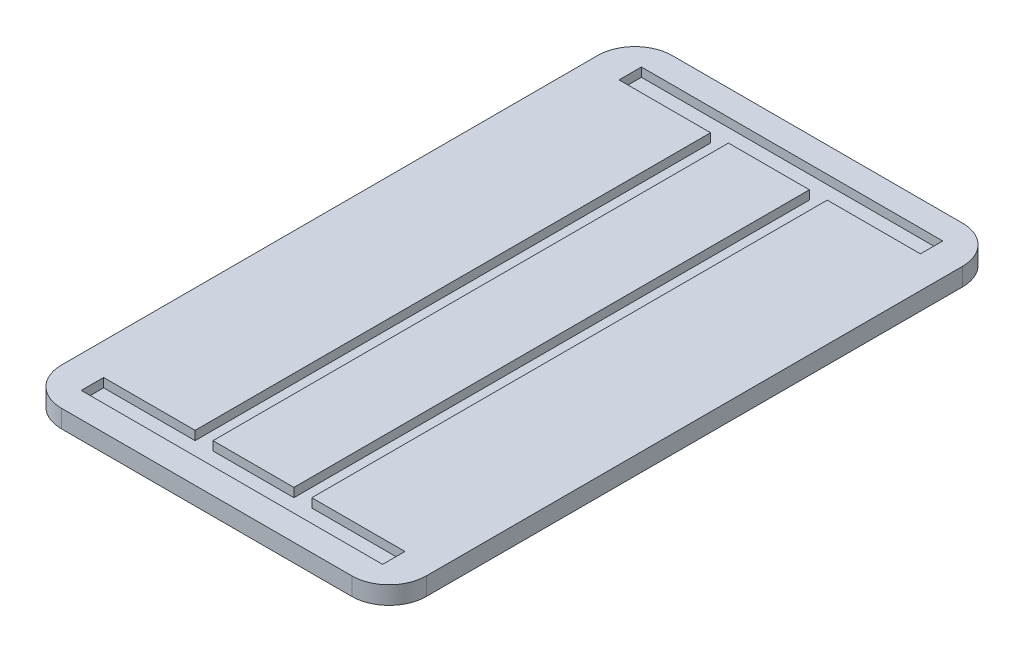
ISO-10303-21;
HEADER;
FILE_DESCRIPTION(('STEP AP214'),'2;1');
FILE_NAME('part.step','',(''),(''),'','','');
FILE_SCHEMA(('AUTOMOTIVE_DESIGN { 1 0 10303 214 1 1 1 1 }'));
ENDSEC;
DATA;
#1=APPLICATION_CONTEXT('core data for automotive mechanical design processes');
#2=APPLICATION_PROTOCOL_DEFINITION('international standard','automotive_design',2000,#1);
#3=PRODUCT_CONTEXT('',#1,'mechanical');
#4=PRODUCT('Part','Part','',(#3));
#5=PRODUCT_RELATED_PRODUCT_CATEGORY('part','',(#4));
#6=PRODUCT_DEFINITION_FORMATION('','',#4);
#7=PRODUCT_DEFINITION_CONTEXT('part definition',#1,'design');
#8=PRODUCT_DEFINITION('design','',#6,#7);
#9=PRODUCT_DEFINITION_SHAPE('','',#8);
#10=(LENGTH_UNIT() NAMED_UNIT(*) SI_UNIT(.MILLI.,.METRE.));
#11=(NAMED_UNIT(*) PLANE_ANGLE_UNIT() SI_UNIT($,.RADIAN.));
#12=(NAMED_UNIT(*) SI_UNIT($,.STERADIAN.) SOLID_ANGLE_UNIT());
#13=UNCERTAINTY_MEASURE_WITH_UNIT(LENGTH_MEASURE(1.E-05),#10,'distance_accuracy_value','');
#14=(GEOMETRIC_REPRESENTATION_CONTEXT(3) GLOBAL_UNCERTAINTY_ASSIGNED_CONTEXT((#13)) GLOBAL_UNIT_ASSIGNED_CONTEXT((#10,
#11,#12)) REPRESENTATION_CONTEXT('',''));
#15=CARTESIAN_POINT('',(0.,0.,0.));
#16=DIRECTION('',(0.,0.,1.));
#17=DIRECTION('',(1.,0.,0.));
#18=AXIS2_PLACEMENT_3D('',#15,#16,#17);
#19=CARTESIAN_POINT('',(101.14,12.,0.));
#20=DIRECTION('',(1.,0.,0.));
#21=DIRECTION('',(0.,0.,-1.));
#22=AXIS2_PLACEMENT_3D('',#19,#20,#21);
#23=PLANE('',#22);
#24=DIRECTION('',(0.,-1.,0.));
#25=VECTOR('',#24,1.);
#26=CARTESIAN_POINT('',(101.14,12.,-188.));
#27=LINE('',#26,#25);
#28=CARTESIAN_POINT('',(101.14,12.,-188.));
#29=VERTEX_POINT('',#28);
#30=CARTESIAN_POINT('',(101.14,6.,-188.));
#31=VERTEX_POINT('',#30);
#32=EDGE_CURVE('E379',#29,#31,#27,.T.);
#33=ORIENTED_EDGE('',*,*,#32,.T.);
#34=DIRECTION('',(0.,0.,1.));
#35=VECTOR('',#34,1.);
#36=CARTESIAN_POINT('',(101.14,6.,0.));
#37=LINE('',#36,#35);
#38=CARTESIAN_POINT('',(101.14,6.,-173.));
#39=VERTEX_POINT('',#38);
#40=EDGE_CURVE('E87',#31,#39,#37,.T.);
#41=ORIENTED_EDGE('',*,*,#40,.T.);
#42=DIRECTION('',(0.,-1.,0.));
#43=VECTOR('',#42,1.);
#44=CARTESIAN_POINT('',(101.14,12.,-173.));
#45=LINE('',#44,#43);
#46=CARTESIAN_POINT('',(101.14,12.,-173.));
#47=VERTEX_POINT('',#46);
#48=EDGE_CURVE('E12',#47,#39,#45,.T.);
#49=ORIENTED_EDGE('',*,*,#48,.F.);
#50=DIRECTION('',(0.,0.,1.));
#51=VECTOR('',#50,1.);
#52=CARTESIAN_POINT('',(101.14,12.,0.));
#53=LINE('',#52,#51);
#54=EDGE_CURVE('E327',#29,#47,#53,.T.);
#55=ORIENTED_EDGE('',*,*,#54,.F.);
#56=EDGE_LOOP('',(#33,#41,#49,#55));
#57=FACE_BOUND('',#56,.T.);
#58=ADVANCED_FACE('F70',(#57),#23,.F.);
#59=CARTESIAN_POINT('',(0.,12.,-173.));
#60=DIRECTION('',(0.,0.,1.));
#61=DIRECTION('',(1.,0.,0.));
#62=AXIS2_PLACEMENT_3D('',#59,#60,#61);
#63=PLANE('',#62);
#64=ORIENTED_EDGE('',*,*,#48,.T.);
#65=DIRECTION('',(-1.,0.,0.));
#66=VECTOR('',#65,1.);
#67=CARTESIAN_POINT('',(0.,6.,-173.));
#68=LINE('',#67,#66);
#69=CARTESIAN_POINT('',(38.6199999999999,6.,-173.));
#70=VERTEX_POINT('',#69);
#71=EDGE_CURVE('E93',#39,#70,#68,.T.);
#72=ORIENTED_EDGE('',*,*,#71,.T.);
#73=DIRECTION('',(0.,-1.,0.));
#74=VECTOR('',#73,1.);
#75=CARTESIAN_POINT('',(38.6199999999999,12.,-173.));
#76=LINE('',#75,#74);
#77=CARTESIAN_POINT('',(38.6199999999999,12.,-173.));
#78=VERTEX_POINT('',#77);
#79=EDGE_CURVE('E79',#78,#70,#76,.T.);
#80=ORIENTED_EDGE('',*,*,#79,.F.);
#81=DIRECTION('',(-1.,0.,0.));
#82=VECTOR('',#81,1.);
#83=CARTESIAN_POINT('',(0.,12.,-173.));
#84=LINE('',#83,#82);
#85=EDGE_CURVE('E330',#47,#78,#84,.T.);
#86=ORIENTED_EDGE('',*,*,#85,.F.);
#87=EDGE_LOOP('',(#64,#72,#80,#86));
#88=FACE_BOUND('',#87,.T.);
#89=ADVANCED_FACE('F466',(#88),#63,.F.);
#90=CARTESIAN_POINT('',(38.6199999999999,12.,0.));
#91=DIRECTION('',(1.,0.,0.));
#92=DIRECTION('',(0.,0.,-1.));
#93=AXIS2_PLACEMENT_3D('',#90,#91,#92);
#94=PLANE('',#93);
#95=ORIENTED_EDGE('',*,*,#79,.T.);
#96=DIRECTION('',(0.,0.,1.));
#97=VECTOR('',#96,1.);
#98=CARTESIAN_POINT('',(38.6199999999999,6.,0.));
#99=LINE('',#98,#97);
#100=CARTESIAN_POINT('',(38.6199999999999,6.,173.));
#101=VERTEX_POINT('',#100);
#102=EDGE_CURVE('E293',#70,#101,#99,.T.);
#103=ORIENTED_EDGE('',*,*,#102,.T.);
#104=DIRECTION('',(0.,-1.,0.));
#105=VECTOR('',#104,1.);
#106=CARTESIAN_POINT('',(38.6199999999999,12.,173.));
#107=LINE('',#106,#105);
#108=CARTESIAN_POINT('',(38.6199999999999,12.,173.));
#109=VERTEX_POINT('',#108);
#110=EDGE_CURVE('E404',#109,#101,#107,.T.);
#111=ORIENTED_EDGE('',*,*,#110,.F.);
#112=DIRECTION('',(0.,0.,1.));
#113=VECTOR('',#112,1.);
#114=CARTESIAN_POINT('',(38.6199999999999,12.,0.));
#115=LINE('',#114,#113);
#116=EDGE_CURVE('E332',#78,#109,#115,.T.);
#117=ORIENTED_EDGE('',*,*,#116,.F.);
#118=EDGE_LOOP('',(#95,#103,#111,#117));
#119=FACE_BOUND('',#118,.T.);
#120=ADVANCED_FACE('F476',(#119),#94,.F.);
#121=CARTESIAN_POINT('',(0.,12.,173.));
#122=DIRECTION('',(0.,0.,-1.));
#123=DIRECTION('',(-1.,0.,0.));
#124=AXIS2_PLACEMENT_3D('',#121,#122,#123);
#125=PLANE('',#124);
#126=ORIENTED_EDGE('',*,*,#110,.T.);
#127=DIRECTION('',(1.,0.,0.));
#128=VECTOR('',#127,1.);
#129=CARTESIAN_POINT('',(0.,6.,173.));
#130=LINE('',#129,#128);
#131=CARTESIAN_POINT('',(101.14,6.,173.));
#132=VERTEX_POINT('',#131);
#133=EDGE_CURVE('E291',#101,#132,#130,.T.);
#134=ORIENTED_EDGE('',*,*,#133,.T.);
#135=DIRECTION('',(0.,-1.,0.));
#136=VECTOR('',#135,1.);
#137=CARTESIAN_POINT('',(101.14,12.,173.));
#138=LINE('',#137,#136);
#139=CARTESIAN_POINT('',(101.14,12.,173.));
#140=VERTEX_POINT('',#139);
#141=EDGE_CURVE('E401',#140,#132,#138,.T.);
#142=ORIENTED_EDGE('',*,*,#141,.F.);
#143=DIRECTION('',(1.,0.,0.));
#144=VECTOR('',#143,1.);
#145=CARTESIAN_POINT('',(0.,12.,173.));
#146=LINE('',#145,#144);
#147=EDGE_CURVE('E334',#109,#140,#146,.T.);
#148=ORIENTED_EDGE('',*,*,#147,.F.);
#149=EDGE_LOOP('',(#126,#134,#142,#148));
#150=FACE_BOUND('',#149,.T.);
#151=ADVANCED_FACE('F480',(#150),#125,.F.);
#152=CARTESIAN_POINT('',(101.14,12.,0.));
#153=DIRECTION('',(1.,0.,0.));
#154=DIRECTION('',(0.,0.,-1.));
#155=AXIS2_PLACEMENT_3D('',#152,#153,#154);
#156=PLANE('',#155);
#157=ORIENTED_EDGE('',*,*,#141,.T.);
#158=DIRECTION('',(0.,0.,1.));
#159=VECTOR('',#158,1.);
#160=CARTESIAN_POINT('',(101.14,6.,0.));
#161=LINE('',#160,#159);
#162=CARTESIAN_POINT('',(101.14,6.,188.));
#163=VERTEX_POINT('',#162);
#164=EDGE_CURVE('E289',#132,#163,#161,.T.);
#165=ORIENTED_EDGE('',*,*,#164,.T.);
#166=DIRECTION('',(0.,-1.,0.));
#167=VECTOR('',#166,1.);
#168=CARTESIAN_POINT('',(101.14,12.,188.));
#169=LINE('',#168,#167);
#170=CARTESIAN_POINT('',(101.14,12.,188.));
#171=VERTEX_POINT('',#170);
#172=EDGE_CURVE('E398',#171,#163,#169,.T.);
#173=ORIENTED_EDGE('',*,*,#172,.F.);
#174=DIRECTION('',(0.,0.,1.));
#175=VECTOR('',#174,1.);
#176=CARTESIAN_POINT('',(101.14,12.,0.));
#177=LINE('',#176,#175);
#178=EDGE_CURVE('E336',#140,#171,#177,.T.);
#179=ORIENTED_EDGE('',*,*,#178,.F.);
#180=EDGE_LOOP('',(#157,#165,#173,#179));
#181=FACE_BOUND('',#180,.T.);
#182=ADVANCED_FACE('F488',(#181),#156,.F.);
#183=CARTESIAN_POINT('',(0.,12.,188.));
#184=DIRECTION('',(0.,0.,1.));
#185=DIRECTION('',(1.,0.,0.));
#186=AXIS2_PLACEMENT_3D('',#183,#184,#185);
#187=PLANE('',#186);
#188=ORIENTED_EDGE('',*,*,#172,.T.);
#189=DIRECTION('',(1.,0.,0.));
#190=VECTOR('',#189,1.);
#191=CARTESIAN_POINT('',(0.,6.,188.));
#192=LINE('',#191,#190);
#193=CARTESIAN_POINT('',(-101.14,6.,188.));
#194=VERTEX_POINT('',#193);
#195=EDGE_CURVE('E286',#194,#163,#192,.T.);
#196=ORIENTED_EDGE('',*,*,#195,.F.);
#197=DIRECTION('',(0.,-1.,0.));
#198=VECTOR('',#197,1.);
#199=CARTESIAN_POINT('',(-101.14,12.,188.));
#200=LINE('',#199,#198);
#201=CARTESIAN_POINT('',(-101.14,12.,188.));
#202=VERTEX_POINT('',#201);
#203=EDGE_CURVE('E395',#202,#194,#200,.T.);
#204=ORIENTED_EDGE('',*,*,#203,.F.);
#205=DIRECTION('',(-1.,0.,0.));
#206=VECTOR('',#205,1.);
#207=CARTESIAN_POINT('',(0.,12.,188.));
#208=LINE('',#207,#206);
#209=EDGE_CURVE('E338',#171,#202,#208,.T.);
#210=ORIENTED_EDGE('',*,*,#209,.F.);
#211=EDGE_LOOP('',(#188,#196,#204,#210));
#212=FACE_BOUND('',#211,.T.);
#213=ADVANCED_FACE('F490',(#212),#187,.F.);
#214=CARTESIAN_POINT('',(-101.14,12.,0.));
#215=DIRECTION('',(1.,0.,0.));
#216=DIRECTION('',(0.,0.,-1.));
#217=AXIS2_PLACEMENT_3D('',#214,#215,#216);
#218=PLANE('',#217);
#219=DIRECTION('',(0.,0.,1.));
#220=VECTOR('',#219,1.);
#221=CARTESIAN_POINT('',(-101.14,6.,0.));
#222=LINE('',#221,#220);
#223=CARTESIAN_POINT('',(-101.14,6.,173.));
#224=VERTEX_POINT('',#223);
#225=EDGE_CURVE('E283',#224,#194,#222,.T.);
#226=ORIENTED_EDGE('',*,*,#225,.F.);
#227=DIRECTION('',(0.,-1.,0.));
#228=VECTOR('',#227,1.);
#229=CARTESIAN_POINT('',(-101.14,12.,173.));
#230=LINE('',#229,#228);
#231=CARTESIAN_POINT('',(-101.14,12.,173.));
#232=VERTEX_POINT('',#231);
#233=EDGE_CURVE('E392',#232,#224,#230,.T.);
#234=ORIENTED_EDGE('',*,*,#233,.F.);
#235=DIRECTION('',(0.,0.,1.));
#236=VECTOR('',#235,1.);
#237=CARTESIAN_POINT('',(-101.14,12.,0.));
#238=LINE('',#237,#236);
#239=EDGE_CURVE('E340',#232,#202,#238,.T.);
#240=ORIENTED_EDGE('',*,*,#239,.T.);
#241=ORIENTED_EDGE('',*,*,#203,.T.);
#242=EDGE_LOOP('',(#226,#234,#240,#241));
#243=FACE_BOUND('',#242,.T.);
#244=ADVANCED_FACE('F492',(#243),#218,.T.);
#245=CARTESIAN_POINT('',(0.,12.,173.));
#246=DIRECTION('',(0.,0.,1.));
#247=DIRECTION('',(1.,0.,0.));
#248=AXIS2_PLACEMENT_3D('',#245,#246,#247);
#249=PLANE('',#248);
#250=DIRECTION('',(-1.,0.,0.));
#251=VECTOR('',#250,1.);
#252=CARTESIAN_POINT('',(0.,6.,173.));
#253=LINE('',#252,#251);
#254=CARTESIAN_POINT('',(-39.7100000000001,6.,173.));
#255=VERTEX_POINT('',#254);
#256=EDGE_CURVE('E280',#255,#224,#253,.T.);
#257=ORIENTED_EDGE('',*,*,#256,.F.);
#258=DIRECTION('',(0.,-1.,0.));
#259=VECTOR('',#258,1.);
#260=CARTESIAN_POINT('',(-39.7100000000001,12.,173.));
#261=LINE('',#260,#259);
#262=CARTESIAN_POINT('',(-39.7100000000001,12.,173.));
#263=VERTEX_POINT('',#262);
#264=EDGE_CURVE('E389',#263,#255,#261,.T.);
#265=ORIENTED_EDGE('',*,*,#264,.F.);
#266=DIRECTION('',(-1.,0.,0.));
#267=VECTOR('',#266,1.);
#268=CARTESIAN_POINT('',(0.,12.,173.));
#269=LINE('',#268,#267);
#270=EDGE_CURVE('E343',#263,#232,#269,.T.);
#271=ORIENTED_EDGE('',*,*,#270,.T.);
#272=ORIENTED_EDGE('',*,*,#233,.T.);
#273=EDGE_LOOP('',(#257,#265,#271,#272));
#274=FACE_BOUND('',#273,.T.);
#275=ADVANCED_FACE('F496',(#274),#249,.T.);
#276=CARTESIAN_POINT('',(-39.7100000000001,12.,0.));
#277=DIRECTION('',(1.,0.,0.));
#278=DIRECTION('',(0.,0.,-1.));
#279=AXIS2_PLACEMENT_3D('',#276,#277,#278);
#280=PLANE('',#279);
#281=DIRECTION('',(0.,0.,-1.));
#282=VECTOR('',#281,1.);
#283=CARTESIAN_POINT('',(-39.7100000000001,6.,0.));
#284=LINE('',#283,#282);
#285=CARTESIAN_POINT('',(-39.7100000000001,6.,-173.));
#286=VERTEX_POINT('',#285);
#287=EDGE_CURVE('E278',#255,#286,#284,.T.);
#288=ORIENTED_EDGE('',*,*,#287,.T.);
#289=DIRECTION('',(0.,-1.,0.));
#290=VECTOR('',#289,1.);
#291=CARTESIAN_POINT('',(-39.7100000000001,12.,-173.));
#292=LINE('',#291,#290);
#293=CARTESIAN_POINT('',(-39.7100000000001,12.,-173.));
#294=VERTEX_POINT('',#293);
#295=EDGE_CURVE('E386',#294,#286,#292,.T.);
#296=ORIENTED_EDGE('',*,*,#295,.F.);
#297=DIRECTION('',(0.,0.,1.));
#298=VECTOR('',#297,1.);
#299=CARTESIAN_POINT('',(-39.7100000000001,12.,0.));
#300=LINE('',#299,#298);
#301=EDGE_CURVE('E346',#294,#263,#300,.T.);
#302=ORIENTED_EDGE('',*,*,#301,.T.);
#303=ORIENTED_EDGE('',*,*,#264,.T.);
#304=EDGE_LOOP('',(#288,#296,#302,#303));
#305=FACE_BOUND('',#304,.T.);
#306=ADVANCED_FACE('F499',(#305),#280,.T.);
#307=CARTESIAN_POINT('',(0.,12.,-173.));
#308=DIRECTION('',(0.,0.,-1.));
#309=DIRECTION('',(-1.,0.,0.));
#310=AXIS2_PLACEMENT_3D('',#307,#308,#309);
#311=PLANE('',#310);
#312=DIRECTION('',(1.,0.,0.));
#313=VECTOR('',#312,1.);
#314=CARTESIAN_POINT('',(0.,6.,-173.));
#315=LINE('',#314,#313);
#316=CARTESIAN_POINT('',(-101.14,6.,-173.));
#317=VERTEX_POINT('',#316);
#318=EDGE_CURVE('E275',#317,#286,#315,.T.);
#319=ORIENTED_EDGE('',*,*,#318,.F.);
#320=DIRECTION('',(0.,-1.,0.));
#321=VECTOR('',#320,1.);
#322=CARTESIAN_POINT('',(-101.14,12.,-173.));
#323=LINE('',#322,#321);
#324=CARTESIAN_POINT('',(-101.14,12.,-173.));
#325=VERTEX_POINT('',#324);
#326=EDGE_CURVE('E383',#325,#317,#323,.T.);
#327=ORIENTED_EDGE('',*,*,#326,.F.);
#328=DIRECTION('',(1.,0.,0.));
#329=VECTOR('',#328,1.);
#330=CARTESIAN_POINT('',(0.,12.,-173.));
#331=LINE('',#330,#329);
#332=EDGE_CURVE('E349',#325,#294,#331,.T.);
#333=ORIENTED_EDGE('',*,*,#332,.T.);
#334=ORIENTED_EDGE('',*,*,#295,.T.);
#335=EDGE_LOOP('',(#319,#327,#333,#334));
#336=FACE_BOUND('',#335,.T.);
#337=ADVANCED_FACE('F502',(#336),#311,.T.);
#338=CARTESIAN_POINT('',(-101.14,12.,0.));
#339=DIRECTION('',(1.,0.,0.));
#340=DIRECTION('',(0.,0.,-1.));
#341=AXIS2_PLACEMENT_3D('',#338,#339,#340);
#342=PLANE('',#341);
#343=DIRECTION('',(0.,0.,1.));
#344=VECTOR('',#343,1.);
#345=CARTESIAN_POINT('',(-101.14,6.,0.));
#346=LINE('',#345,#344);
#347=CARTESIAN_POINT('',(-101.14,6.,-188.));
#348=VERTEX_POINT('',#347);
#349=EDGE_CURVE('E272',#348,#317,#346,.T.);
#350=ORIENTED_EDGE('',*,*,#349,.F.);
#351=DIRECTION('',(0.,-1.,0.));
#352=VECTOR('',#351,1.);
#353=CARTESIAN_POINT('',(-101.14,12.,-188.));
#354=LINE('',#353,#352);
#355=CARTESIAN_POINT('',(-101.14,12.,-188.));
#356=VERTEX_POINT('',#355);
#357=EDGE_CURVE('E381',#356,#348,#354,.T.);
#358=ORIENTED_EDGE('',*,*,#357,.F.);
#359=DIRECTION('',(0.,0.,1.));
#360=VECTOR('',#359,1.);
#361=CARTESIAN_POINT('',(-101.14,12.,0.));
#362=LINE('',#361,#360);
#363=EDGE_CURVE('E352',#356,#325,#362,.T.);
#364=ORIENTED_EDGE('',*,*,#363,.T.);
#365=ORIENTED_EDGE('',*,*,#326,.T.);
#366=EDGE_LOOP('',(#350,#358,#364,#365));
#367=FACE_BOUND('',#366,.T.);
#368=ADVANCED_FACE('F505',(#367),#342,.T.);
#369=CARTESIAN_POINT('',(97.5,12.,-180.));
#370=DIRECTION('',(0.,-1.,0.));
#371=DIRECTION('',(0.,0.,-1.));
#372=AXIS2_PLACEMENT_3D('',#369,#370,#371);
#373=CYLINDRICAL_SURFACE('',#372,25.);
#374=CARTESIAN_POINT('',(97.5,0.,-180.));
#375=DIRECTION('',(0.,1.,0.));
#376=DIRECTION('',(0.,0.,1.));
#377=AXIS2_PLACEMENT_3D('',#374,#375,#376);
#378=CIRCLE('',#377,25.);
#379=CARTESIAN_POINT('',(97.4999999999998,0.,-205.));
#380=VERTEX_POINT('',#379);
#381=CARTESIAN_POINT('',(122.5,0.,-180.));
#382=VERTEX_POINT('',#381);
#383=EDGE_CURVE('E304',#380,#382,#378,.F.);
#384=ORIENTED_EDGE('',*,*,#383,.F.);
#385=DIRECTION('',(0.,-1.,0.));
#386=VECTOR('',#385,1.);
#387=CARTESIAN_POINT('',(97.4999999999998,12.,-205.));
#388=LINE('',#387,#386);
#389=CARTESIAN_POINT('',(97.4999999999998,12.,-205.));
#390=VERTEX_POINT('',#389);
#391=EDGE_CURVE('E74',#390,#380,#388,.T.);
#392=ORIENTED_EDGE('',*,*,#391,.F.);
#393=CARTESIAN_POINT('',(97.5,12.,-180.));
#394=DIRECTION('',(0.,1.,0.));
#395=DIRECTION('',(0.,0.,1.));
#396=AXIS2_PLACEMENT_3D('',#393,#394,#395);
#397=CIRCLE('',#396,25.);
#398=CARTESIAN_POINT('',(122.5,12.,-180.));
#399=VERTEX_POINT('',#398);
#400=EDGE_CURVE('E305',#390,#399,#397,.F.);
#401=ORIENTED_EDGE('',*,*,#400,.T.);
#402=DIRECTION('',(0.,-1.,0.));
#403=VECTOR('',#402,1.);
#404=CARTESIAN_POINT('',(122.5,12.,-180.));
#405=LINE('',#404,#403);
#406=EDGE_CURVE('E358',#399,#382,#405,.T.);
#407=ORIENTED_EDGE('',*,*,#406,.T.);
#408=EDGE_LOOP('',(#384,#392,#401,#407));
#409=FACE_BOUND('',#408,.T.);
#410=ADVANCED_FACE('F72',(#409),#373,.T.);
#411=CARTESIAN_POINT('',(0.,12.,-205.));
#412=DIRECTION('',(0.,0.,1.));
#413=DIRECTION('',(1.,0.,0.));
#414=AXIS2_PLACEMENT_3D('',#411,#412,#413);
#415=PLANE('',#414);
#416=DIRECTION('',(-1.,0.,0.));
#417=VECTOR('',#416,1.);
#418=CARTESIAN_POINT('',(0.,0.,-205.));
#419=LINE('',#418,#417);
#420=CARTESIAN_POINT('',(-97.4999999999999,0.,-205.));
#421=VERTEX_POINT('',#420);
#422=EDGE_CURVE('E361',#380,#421,#419,.T.);
#423=ORIENTED_EDGE('',*,*,#422,.T.);
#424=DIRECTION('',(0.,-1.,0.));
#425=VECTOR('',#424,1.);
#426=CARTESIAN_POINT('',(-97.4999999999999,12.,-205.));
#427=LINE('',#426,#425);
#428=CARTESIAN_POINT('',(-97.4999999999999,12.,-205.));
#429=VERTEX_POINT('',#428);
#430=EDGE_CURVE('E419',#429,#421,#427,.T.);
#431=ORIENTED_EDGE('',*,*,#430,.F.);
#432=DIRECTION('',(-1.,0.,0.));
#433=VECTOR('',#432,1.);
#434=CARTESIAN_POINT('',(0.,12.,-205.));
#435=LINE('',#434,#433);
#436=EDGE_CURVE('E308',#390,#429,#435,.T.);
#437=ORIENTED_EDGE('',*,*,#436,.F.);
#438=ORIENTED_EDGE('',*,*,#391,.T.);
#439=EDGE_LOOP('',(#423,#431,#437,#438));
#440=FACE_BOUND('',#439,.T.);
#441=ADVANCED_FACE('F428',(#440),#415,.F.);
#442=CARTESIAN_POINT('',(-97.5,12.,-180.));
#443=DIRECTION('',(0.,-1.,0.));
#444=DIRECTION('',(0.,0.,-1.));
#445=AXIS2_PLACEMENT_3D('',#442,#443,#444);
#446=CYLINDRICAL_SURFACE('',#445,25.);
#447=CARTESIAN_POINT('',(-97.5,0.,-180.));
#448=DIRECTION('',(0.,1.,0.));
#449=DIRECTION('',(0.,0.,1.));
#450=AXIS2_PLACEMENT_3D('',#447,#448,#449);
#451=CIRCLE('',#450,25.);
#452=CARTESIAN_POINT('',(-122.5,0.,-180.));
#453=VERTEX_POINT('',#452);
#454=EDGE_CURVE('E363',#421,#453,#451,.T.);
#455=ORIENTED_EDGE('',*,*,#454,.T.);
#456=DIRECTION('',(0.,-1.,0.));
#457=VECTOR('',#456,1.);
#458=CARTESIAN_POINT('',(-122.5,12.,-180.));
#459=LINE('',#458,#457);
#460=CARTESIAN_POINT('',(-122.5,12.,-180.));
#461=VERTEX_POINT('',#460);
#462=EDGE_CURVE('E417',#461,#453,#459,.T.);
#463=ORIENTED_EDGE('',*,*,#462,.F.);
#464=CARTESIAN_POINT('',(-97.5,12.,-180.));
#465=DIRECTION('',(0.,1.,0.));
#466=DIRECTION('',(0.,0.,1.));
#467=AXIS2_PLACEMENT_3D('',#464,#465,#466);
#468=CIRCLE('',#467,25.);
#469=EDGE_CURVE('E311',#429,#461,#468,.T.);
#470=ORIENTED_EDGE('',*,*,#469,.F.);
#471=ORIENTED_EDGE('',*,*,#430,.T.);
#472=EDGE_LOOP('',(#455,#463,#470,#471));
#473=FACE_BOUND('',#472,.T.);
#474=ADVANCED_FACE('F456',(#473),#446,.T.);
#475=CARTESIAN_POINT('',(-122.5,12.,0.));
#476=DIRECTION('',(1.,0.,0.));
#477=DIRECTION('',(0.,0.,-1.));
#478=AXIS2_PLACEMENT_3D('',#475,#476,#477);
#479=PLANE('',#478);
#480=DIRECTION('',(0.,0.,1.));
#481=VECTOR('',#480,1.);
#482=CARTESIAN_POINT('',(-122.5,0.,0.));
#483=LINE('',#482,#481);
#484=CARTESIAN_POINT('',(-122.5,0.,180.));
#485=VERTEX_POINT('',#484);
#486=EDGE_CURVE('E365',#453,#485,#483,.T.);
#487=ORIENTED_EDGE('',*,*,#486,.T.);
#488=DIRECTION('',(0.,-1.,0.));
#489=VECTOR('',#488,1.);
#490=CARTESIAN_POINT('',(-122.5,12.,180.));
#491=LINE('',#490,#489);
#492=CARTESIAN_POINT('',(-122.5,12.,180.));
#493=VERTEX_POINT('',#492);
#494=EDGE_CURVE('E415',#493,#485,#491,.T.);
#495=ORIENTED_EDGE('',*,*,#494,.F.);
#496=DIRECTION('',(0.,0.,1.));
#497=VECTOR('',#496,1.);
#498=CARTESIAN_POINT('',(-122.5,12.,0.));
#499=LINE('',#498,#497);
#500=EDGE_CURVE('E313',#461,#493,#499,.T.);
#501=ORIENTED_EDGE('',*,*,#500,.F.);
#502=ORIENTED_EDGE('',*,*,#462,.T.);
#503=EDGE_LOOP('',(#487,#495,#501,#502));
#504=FACE_BOUND('',#503,.T.);
#505=ADVANCED_FACE('F453',(#504),#479,.F.);
#506=CARTESIAN_POINT('',(-97.5,12.,180.));
#507=DIRECTION('',(0.,-1.,0.));
#508=DIRECTION('',(0.,0.,-1.));
#509=AXIS2_PLACEMENT_3D('',#506,#507,#508);
#510=CYLINDRICAL_SURFACE('',#509,25.);
#511=CARTESIAN_POINT('',(-97.5,0.,180.));
#512=DIRECTION('',(0.,1.,0.));
#513=DIRECTION('',(0.,0.,1.));
#514=AXIS2_PLACEMENT_3D('',#511,#512,#513);
#515=CIRCLE('',#514,25.);
#516=CARTESIAN_POINT('',(-97.4999999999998,0.,205.));
#517=VERTEX_POINT('',#516);
#518=EDGE_CURVE('E368',#517,#485,#515,.F.);
#519=ORIENTED_EDGE('',*,*,#518,.F.);
#520=DIRECTION('',(0.,-1.,0.));
#521=VECTOR('',#520,1.);
#522=CARTESIAN_POINT('',(-97.4999999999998,12.,205.));
#523=LINE('',#522,#521);
#524=CARTESIAN_POINT('',(-97.4999999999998,12.,205.));
#525=VERTEX_POINT('',#524);
#526=EDGE_CURVE('E413',#525,#517,#523,.T.);
#527=ORIENTED_EDGE('',*,*,#526,.F.);
#528=CARTESIAN_POINT('',(-97.5,12.,180.));
#529=DIRECTION('',(0.,1.,0.));
#530=DIRECTION('',(0.,0.,1.));
#531=AXIS2_PLACEMENT_3D('',#528,#529,#530);
#532=CIRCLE('',#531,25.);
#533=EDGE_CURVE('E315',#525,#493,#532,.F.);
#534=ORIENTED_EDGE('',*,*,#533,.T.);
#535=ORIENTED_EDGE('',*,*,#494,.T.);
#536=EDGE_LOOP('',(#519,#527,#534,#535));
#537=FACE_BOUND('',#536,.T.);
#538=ADVANCED_FACE('F450',(#537),#510,.T.);
#539=CARTESIAN_POINT('',(0.,12.,205.));
#540=DIRECTION('',(0.,0.,1.));
#541=DIRECTION('',(1.,0.,0.));
#542=AXIS2_PLACEMENT_3D('',#539,#540,#541);
#543=PLANE('',#542);
#544=DIRECTION('',(-1.,0.,0.));
#545=VECTOR('',#544,1.);
#546=CARTESIAN_POINT('',(0.,0.,205.));
#547=LINE('',#546,#545);
#548=CARTESIAN_POINT('',(97.4999999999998,0.,205.));
#549=VERTEX_POINT('',#548);
#550=EDGE_CURVE('E371',#549,#517,#547,.T.);
#551=ORIENTED_EDGE('',*,*,#550,.F.);
#552=DIRECTION('',(0.,-1.,0.));
#553=VECTOR('',#552,1.);
#554=CARTESIAN_POINT('',(97.4999999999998,12.,205.));
#555=LINE('',#554,#553);
#556=CARTESIAN_POINT('',(97.4999999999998,12.,205.));
#557=VERTEX_POINT('',#556);
#558=EDGE_CURVE('E411',#557,#549,#555,.T.);
#559=ORIENTED_EDGE('',*,*,#558,.F.);
#560=DIRECTION('',(-1.,0.,0.));
#561=VECTOR('',#560,1.);
#562=CARTESIAN_POINT('',(0.,12.,205.));
#563=LINE('',#562,#561);
#564=EDGE_CURVE('E318',#557,#525,#563,.T.);
#565=ORIENTED_EDGE('',*,*,#564,.T.);
#566=ORIENTED_EDGE('',*,*,#526,.T.);
#567=EDGE_LOOP('',(#551,#559,#565,#566));
#568=FACE_BOUND('',#567,.T.);
#569=ADVANCED_FACE('F446',(#568),#543,.T.);
#570=CARTESIAN_POINT('',(97.5,12.,180.));
#571=DIRECTION('',(0.,-1.,0.));
#572=DIRECTION('',(0.,0.,-1.));
#573=AXIS2_PLACEMENT_3D('',#570,#571,#572);
#574=CYLINDRICAL_SURFACE('',#573,25.);
#575=CARTESIAN_POINT('',(97.5,0.,180.));
#576=DIRECTION('',(0.,1.,0.));
#577=DIRECTION('',(0.,0.,1.));
#578=AXIS2_PLACEMENT_3D('',#575,#576,#577);
#579=CIRCLE('',#578,25.);
#580=CARTESIAN_POINT('',(122.5,0.,180.));
#581=VERTEX_POINT('',#580);
#582=EDGE_CURVE('E374',#581,#549,#579,.F.);
#583=ORIENTED_EDGE('',*,*,#582,.F.);
#584=DIRECTION('',(0.,-1.,0.));
#585=VECTOR('',#584,1.);
#586=CARTESIAN_POINT('',(122.5,12.,180.));
#587=LINE('',#586,#585);
#588=CARTESIAN_POINT('',(122.5,12.,180.));
#589=VERTEX_POINT('',#588);
#590=EDGE_CURVE('E409',#589,#581,#587,.T.);
#591=ORIENTED_EDGE('',*,*,#590,.F.);
#592=CARTESIAN_POINT('',(97.5,12.,180.));
#593=DIRECTION('',(0.,1.,0.));
#594=DIRECTION('',(0.,0.,1.));
#595=AXIS2_PLACEMENT_3D('',#592,#593,#594);
#596=CIRCLE('',#595,25.);
#597=EDGE_CURVE('E321',#589,#557,#596,.F.);
#598=ORIENTED_EDGE('',*,*,#597,.T.);
#599=ORIENTED_EDGE('',*,*,#558,.T.);
#600=EDGE_LOOP('',(#583,#591,#598,#599));
#601=FACE_BOUND('',#600,.T.);
#602=ADVANCED_FACE('F442',(#601),#574,.T.);
#603=CARTESIAN_POINT('',(122.5,12.,0.));
#604=DIRECTION('',(1.,0.,0.));
#605=DIRECTION('',(0.,0.,-1.));
#606=AXIS2_PLACEMENT_3D('',#603,#604,#605);
#607=PLANE('',#606);
#608=DIRECTION('',(0.,0.,1.));
#609=VECTOR('',#608,1.);
#610=CARTESIAN_POINT('',(122.5,0.,0.));
#611=LINE('',#610,#609);
#612=EDGE_CURVE('E309',#382,#581,#611,.T.);
#613=ORIENTED_EDGE('',*,*,#612,.F.);
#614=ORIENTED_EDGE('',*,*,#406,.F.);
#615=DIRECTION('',(0.,0.,1.));
#616=VECTOR('',#615,1.);
#617=CARTESIAN_POINT('',(122.5,12.,0.));
#618=LINE('',#617,#616);
#619=EDGE_CURVE('E324',#399,#589,#618,.T.);
#620=ORIENTED_EDGE('',*,*,#619,.T.);
#621=ORIENTED_EDGE('',*,*,#590,.T.);
#622=EDGE_LOOP('',(#613,#614,#620,#621));
#623=FACE_BOUND('',#622,.T.);
#624=ADVANCED_FACE('F438',(#623),#607,.T.);
#625=CARTESIAN_POINT('',(0.,12.,-188.));
#626=DIRECTION('',(0.,0.,1.));
#627=DIRECTION('',(1.,0.,0.));
#628=AXIS2_PLACEMENT_3D('',#625,#626,#627);
#629=PLANE('',#628);
#630=DIRECTION('',(1.,0.,0.));
#631=VECTOR('',#630,1.);
#632=CARTESIAN_POINT('',(0.,6.,-188.));
#633=LINE('',#632,#631);
#634=EDGE_CURVE('E270',#348,#31,#633,.T.);
#635=ORIENTED_EDGE('',*,*,#634,.T.);
#636=ORIENTED_EDGE('',*,*,#32,.F.);
#637=DIRECTION('',(-1.,0.,0.));
#638=VECTOR('',#637,1.);
#639=CARTESIAN_POINT('',(0.,12.,-188.));
#640=LINE('',#639,#638);
#641=EDGE_CURVE('E355',#29,#356,#640,.T.);
#642=ORIENTED_EDGE('',*,*,#641,.T.);
#643=ORIENTED_EDGE('',*,*,#357,.T.);
#644=EDGE_LOOP('',(#635,#636,#642,#643));
#645=FACE_BOUND('',#644,.T.);
#646=ADVANCED_FACE('F461',(#645),#629,.T.);
#647=CARTESIAN_POINT('',(0.,12.,0.));
#648=DIRECTION('',(0.,1.,0.));
#649=DIRECTION('',(0.,0.,1.));
#650=AXIS2_PLACEMENT_3D('',#647,#648,#649);
#651=PLANE('',#650);
#652=ORIENTED_EDGE('',*,*,#400,.F.);
#653=ORIENTED_EDGE('',*,*,#436,.T.);
#654=ORIENTED_EDGE('',*,*,#469,.T.);
#655=ORIENTED_EDGE('',*,*,#500,.T.);
#656=ORIENTED_EDGE('',*,*,#533,.F.);
#657=ORIENTED_EDGE('',*,*,#564,.F.);
#658=ORIENTED_EDGE('',*,*,#597,.F.);
#659=ORIENTED_EDGE('',*,*,#619,.F.);
#660=EDGE_LOOP('',(#652,#653,#654,#655,#656,#657,#658,#659));
#661=FACE_BOUND('',#660,.T.);
#662=ORIENTED_EDGE('',*,*,#54,.T.);
#663=ORIENTED_EDGE('',*,*,#85,.T.);
#664=ORIENTED_EDGE('',*,*,#116,.T.);
#665=ORIENTED_EDGE('',*,*,#147,.T.);
#666=ORIENTED_EDGE('',*,*,#178,.T.);
#667=ORIENTED_EDGE('',*,*,#209,.T.);
#668=ORIENTED_EDGE('',*,*,#239,.F.);
#669=ORIENTED_EDGE('',*,*,#270,.F.);
#670=ORIENTED_EDGE('',*,*,#301,.F.);
#671=ORIENTED_EDGE('',*,*,#332,.F.);
#672=ORIENTED_EDGE('',*,*,#363,.F.);
#673=ORIENTED_EDGE('',*,*,#641,.F.);
#674=EDGE_LOOP('',(#662,#663,#664,#665,#666,#667,#668,#669,#670,#671,#672,#673));
#675=FACE_BOUND('',#674,.T.);
#676=ADVANCED_FACE('F458',(#661,#675),#651,.T.);
#677=CARTESIAN_POINT('',(0.,0.,0.));
#678=DIRECTION('',(0.,1.,0.));
#679=DIRECTION('',(0.,0.,1.));
#680=AXIS2_PLACEMENT_3D('',#677,#678,#679);
#681=PLANE('',#680);
#682=ORIENTED_EDGE('',*,*,#383,.T.);
#683=ORIENTED_EDGE('',*,*,#612,.T.);
#684=ORIENTED_EDGE('',*,*,#582,.T.);
#685=ORIENTED_EDGE('',*,*,#550,.T.);
#686=ORIENTED_EDGE('',*,*,#518,.T.);
#687=ORIENTED_EDGE('',*,*,#486,.F.);
#688=ORIENTED_EDGE('',*,*,#454,.F.);
#689=ORIENTED_EDGE('',*,*,#422,.F.);
#690=EDGE_LOOP('',(#682,#683,#684,#685,#686,#687,#688,#689));
#691=FACE_BOUND('',#690,.T.);
#692=ADVANCED_FACE('F433',(#691),#681,.F.);
#693=CARTESIAN_POINT('',(0.,6.,0.));
#694=DIRECTION('',(0.,1.,0.));
#695=DIRECTION('',(0.,0.,1.));
#696=AXIS2_PLACEMENT_3D('',#693,#694,#695);
#697=PLANE('',#696);
#698=ORIENTED_EDGE('',*,*,#71,.F.);
#699=ORIENTED_EDGE('',*,*,#40,.F.);
#700=ORIENTED_EDGE('',*,*,#634,.F.);
#701=ORIENTED_EDGE('',*,*,#349,.T.);
#702=ORIENTED_EDGE('',*,*,#318,.T.);
#703=ORIENTED_EDGE('',*,*,#287,.F.);
#704=ORIENTED_EDGE('',*,*,#256,.T.);
#705=ORIENTED_EDGE('',*,*,#225,.T.);
#706=ORIENTED_EDGE('',*,*,#195,.T.);
#707=ORIENTED_EDGE('',*,*,#164,.F.);
#708=ORIENTED_EDGE('',*,*,#133,.F.);
#709=ORIENTED_EDGE('',*,*,#102,.F.);
#710=EDGE_LOOP('',(#698,#699,#700,#701,#702,#703,#704,#705,#706,#707,#708,#709));
#711=FACE_BOUND('',#710,.T.);
#712=DIRECTION('',(0.,0.,1.));
#713=VECTOR('',#712,1.);
#714=CARTESIAN_POINT('',(-27.7100000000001,6.,0.));
#715=LINE('',#714,#713);
#716=CARTESIAN_POINT('',(-27.7100000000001,6.,-173.));
#717=VERTEX_POINT('',#716);
#718=CARTESIAN_POINT('',(-27.7100000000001,6.,173.));
#719=VERTEX_POINT('',#718);
#720=EDGE_CURVE('E295',#717,#719,#715,.T.);
#721=ORIENTED_EDGE('',*,*,#720,.F.);
#722=DIRECTION('',(1.,0.,0.));
#723=VECTOR('',#722,1.);
#724=CARTESIAN_POINT('',(0.,6.,-173.));
#725=LINE('',#724,#723);
#726=CARTESIAN_POINT('',(26.6199999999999,6.,-173.));
#727=VERTEX_POINT('',#726);
#728=EDGE_CURVE('E243',#717,#727,#725,.T.);
#729=ORIENTED_EDGE('',*,*,#728,.T.);
#730=DIRECTION('',(0.,0.,1.));
#731=VECTOR('',#730,1.);
#732=CARTESIAN_POINT('',(26.6199999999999,6.,0.));
#733=LINE('',#732,#731);
#734=CARTESIAN_POINT('',(26.6199999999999,6.,173.));
#735=VERTEX_POINT('',#734);
#736=EDGE_CURVE('E298',#727,#735,#733,.T.);
#737=ORIENTED_EDGE('',*,*,#736,.T.);
#738=DIRECTION('',(1.,0.,0.));
#739=VECTOR('',#738,1.);
#740=CARTESIAN_POINT('',(0.,6.,173.));
#741=LINE('',#740,#739);
#742=EDGE_CURVE('E301',#719,#735,#741,.T.);
#743=ORIENTED_EDGE('',*,*,#742,.F.);
#744=EDGE_LOOP('',(#721,#729,#737,#743));
#745=FACE_BOUND('',#744,.T.);
#746=ADVANCED_FACE('F469',(#711,#745),#697,.T.);
#747=CARTESIAN_POINT('',(0.,12.,0.));
#748=DIRECTION('',(0.,1.,0.));
#749=DIRECTION('',(0.,0.,1.));
#750=AXIS2_PLACEMENT_3D('',#747,#748,#749);
#751=PLANE('',#750);
#752=DIRECTION('',(1.,0.,0.));
#753=VECTOR('',#752,1.);
#754=CARTESIAN_POINT('',(0.,12.,-173.));
#755=LINE('',#754,#753);
#756=CARTESIAN_POINT('',(-27.7100000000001,12.,-173.));
#757=VERTEX_POINT('',#756);
#758=CARTESIAN_POINT('',(26.6199999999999,12.,-173.));
#759=VERTEX_POINT('',#758);
#760=EDGE_CURVE('E240',#757,#759,#755,.T.);
#761=ORIENTED_EDGE('',*,*,#760,.F.);
#762=DIRECTION('',(0.,0.,1.));
#763=VECTOR('',#762,1.);
#764=CARTESIAN_POINT('',(-27.7100000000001,12.,0.));
#765=LINE('',#764,#763);
#766=CARTESIAN_POINT('',(-27.7100000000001,12.,173.));
#767=VERTEX_POINT('',#766);
#768=EDGE_CURVE('E249',#757,#767,#765,.T.);
#769=ORIENTED_EDGE('',*,*,#768,.T.);
#770=DIRECTION('',(1.,0.,0.));
#771=VECTOR('',#770,1.);
#772=CARTESIAN_POINT('',(0.,12.,173.));
#773=LINE('',#772,#771);
#774=CARTESIAN_POINT('',(26.6199999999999,12.,173.));
#775=VERTEX_POINT('',#774);
#776=EDGE_CURVE('E254',#767,#775,#773,.T.);
#777=ORIENTED_EDGE('',*,*,#776,.T.);
#778=DIRECTION('',(0.,0.,1.));
#779=VECTOR('',#778,1.);
#780=CARTESIAN_POINT('',(26.6199999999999,12.,0.));
#781=LINE('',#780,#779);
#782=EDGE_CURVE('E258',#759,#775,#781,.T.);
#783=ORIENTED_EDGE('',*,*,#782,.F.);
#784=EDGE_LOOP('',(#761,#769,#777,#783));
#785=FACE_BOUND('',#784,.T.);
#786=ADVANCED_FACE('F256',(#785),#751,.T.);
#787=CARTESIAN_POINT('',(26.6199999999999,12.,0.));
#788=DIRECTION('',(1.,0.,0.));
#789=DIRECTION('',(0.,0.,-1.));
#790=AXIS2_PLACEMENT_3D('',#787,#788,#789);
#791=PLANE('',#790);
#792=DIRECTION('',(0.,-1.,0.));
#793=VECTOR('',#792,1.);
#794=CARTESIAN_POINT('',(26.6199999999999,12.,173.));
#795=LINE('',#794,#793);
#796=EDGE_CURVE('E265',#775,#735,#795,.T.);
#797=ORIENTED_EDGE('',*,*,#796,.T.);
#798=ORIENTED_EDGE('',*,*,#736,.F.);
#799=DIRECTION('',(0.,-1.,0.));
#800=VECTOR('',#799,1.);
#801=CARTESIAN_POINT('',(26.6199999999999,12.,-173.));
#802=LINE('',#801,#800);
#803=EDGE_CURVE('E263',#759,#727,#802,.T.);
#804=ORIENTED_EDGE('',*,*,#803,.F.);
#805=ORIENTED_EDGE('',*,*,#782,.T.);
#806=EDGE_LOOP('',(#797,#798,#804,#805));
#807=FACE_BOUND('',#806,.T.);
#808=ADVANCED_FACE('F626',(#807),#791,.T.);
#809=CARTESIAN_POINT('',(0.,12.,173.));
#810=DIRECTION('',(0.,0.,-1.));
#811=DIRECTION('',(-1.,0.,0.));
#812=AXIS2_PLACEMENT_3D('',#809,#810,#811);
#813=PLANE('',#812);
#814=ORIENTED_EDGE('',*,*,#742,.T.);
#815=ORIENTED_EDGE('',*,*,#796,.F.);
#816=ORIENTED_EDGE('',*,*,#776,.F.);
#817=DIRECTION('',(0.,-1.,0.));
#818=VECTOR('',#817,1.);
#819=CARTESIAN_POINT('',(-27.7100000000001,12.,173.));
#820=LINE('',#819,#818);
#821=EDGE_CURVE('E246',#767,#719,#820,.T.);
#822=ORIENTED_EDGE('',*,*,#821,.T.);
#823=EDGE_LOOP('',(#814,#815,#816,#822));
#824=FACE_BOUND('',#823,.T.);
#825=ADVANCED_FACE('F636',(#824),#813,.F.);
#826=CARTESIAN_POINT('',(-27.7100000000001,12.,0.));
#827=DIRECTION('',(1.,0.,0.));
#828=DIRECTION('',(0.,0.,-1.));
#829=AXIS2_PLACEMENT_3D('',#826,#827,#828);
#830=PLANE('',#829);
#831=ORIENTED_EDGE('',*,*,#720,.T.);
#832=ORIENTED_EDGE('',*,*,#821,.F.);
#833=ORIENTED_EDGE('',*,*,#768,.F.);
#834=DIRECTION('',(0.,-1.,0.));
#835=VECTOR('',#834,1.);
#836=CARTESIAN_POINT('',(-27.7100000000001,12.,-173.));
#837=LINE('',#836,#835);
#838=EDGE_CURVE('E235',#757,#717,#837,.T.);
#839=ORIENTED_EDGE('',*,*,#838,.T.);
#840=EDGE_LOOP('',(#831,#832,#833,#839));
#841=FACE_BOUND('',#840,.T.);
#842=ADVANCED_FACE('F250',(#841),#830,.F.);
#843=CARTESIAN_POINT('',(0.,12.,-173.));
#844=DIRECTION('',(0.,0.,-1.));
#845=DIRECTION('',(-1.,0.,0.));
#846=AXIS2_PLACEMENT_3D('',#843,#844,#845);
#847=PLANE('',#846);
#848=ORIENTED_EDGE('',*,*,#803,.T.);
#849=ORIENTED_EDGE('',*,*,#728,.F.);
#850=ORIENTED_EDGE('',*,*,#838,.F.);
#851=ORIENTED_EDGE('',*,*,#760,.T.);
#852=EDGE_LOOP('',(#848,#849,#850,#851));
#853=FACE_BOUND('',#852,.T.);
#854=ADVANCED_FACE('F238',(#853),#847,.T.);
#855=CLOSED_SHELL('',(#58,#89,#120,#151,#182,#213,#244,#275,#306,#337,#368,#410,#441,#474,#505,
#538,#569,#602,#624,#646,#676,#692,#746,#786,#808,#825,#842,#854));
#856=MANIFOLD_SOLID_BREP('B2',#855);
#857=ADVANCED_BREP_SHAPE_REPRESENTATION('',(#18,#856),#14);
#858=SHAPE_DEFINITION_REPRESENTATION(#9,#857);
ENDSEC;
END-ISO-10303-21;
